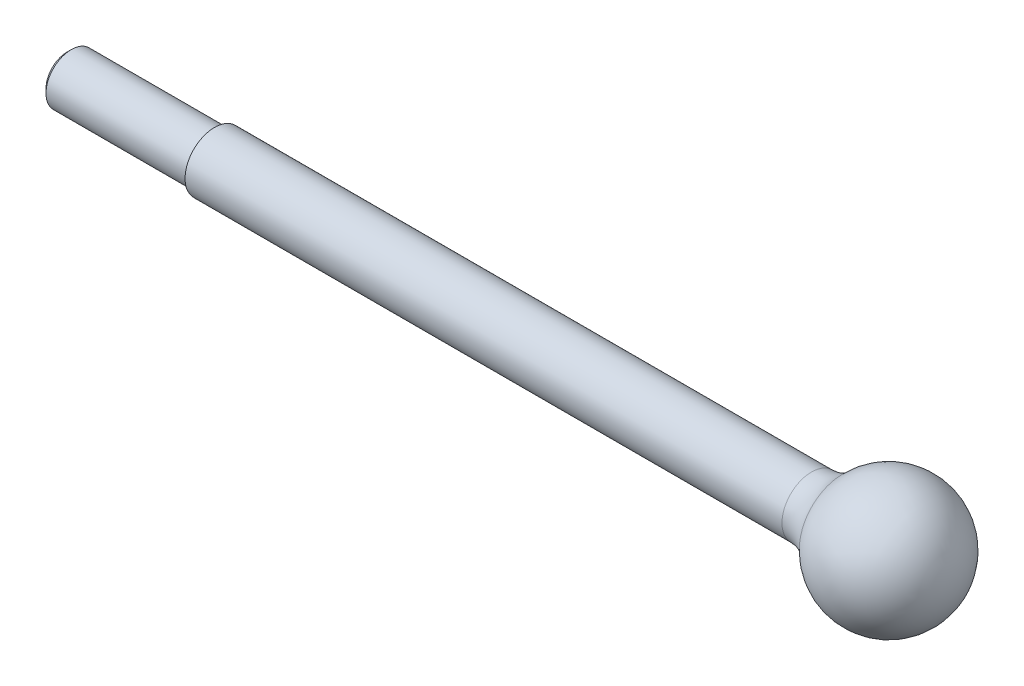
from build123d import *

# Parameters (mm, degrees)
FILLET1_R     = 10
CHAMFER1_SIZE = 1


with BuildPart() as part:
    # Sketch1 → Revolve1 (revolve)
    with BuildSketch(Plane(origin=(0, 0, 0), x_dir=(1, 0, 0), z_dir=(0, 1, 0))):
        with BuildLine():
            Line((15, 0), (-195, 0))
            Line((-195, 0), (-195, 6))
            Line((-195, 6), (-160, 6))
            Line((-160, 6), (-160, 7))
            Line((-160, 7), (-13.266499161, 7))
            ThreePointArc((-13.266499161, 7), (3.605725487, 14.560176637), (15, 0))
        make_face()
    revolve(axis=Axis((15, 0, 0), (-1, 0, 0)))

    # Fillet1
    fillet1_edges = [part.edges().sort_by_distance(p)[0] for p in [
        (-13.266499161, 0, 7),
    ]]
    fillet(fillet1_edges, radius=FILLET1_R)

    # Chamfer1
    chamfer1_edges = [part.edges().sort_by_distance(p)[0] for p in [
        (-195, 0, 6),
    ]]
    chamfer(chamfer1_edges, length=CHAMFER1_SIZE)


solid = part.part
